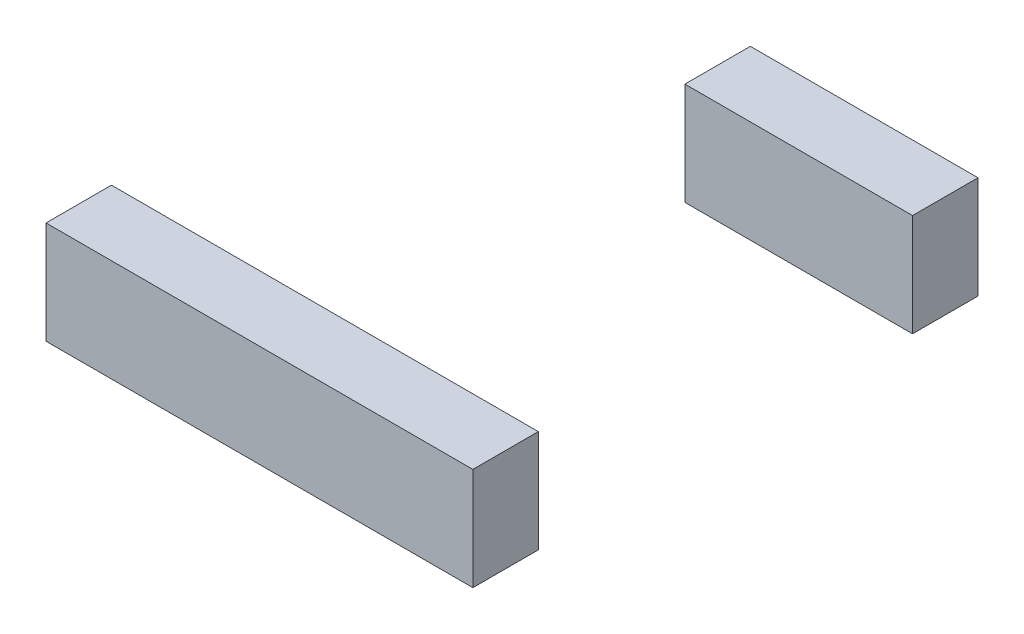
ISO-10303-21;
HEADER;
FILE_DESCRIPTION(('STEP AP214'),'2;1');
FILE_NAME('part.step','',(''),(''),'','','');
FILE_SCHEMA(('AUTOMOTIVE_DESIGN { 1 0 10303 214 1 1 1 1 }'));
ENDSEC;
DATA;
#1=APPLICATION_CONTEXT('core data for automotive mechanical design processes');
#2=APPLICATION_PROTOCOL_DEFINITION('international standard','automotive_design',2000,#1);
#3=PRODUCT_CONTEXT('',#1,'mechanical');
#4=PRODUCT('Part','Part','',(#3));
#5=PRODUCT_RELATED_PRODUCT_CATEGORY('part','',(#4));
#6=PRODUCT_DEFINITION_FORMATION('','',#4);
#7=PRODUCT_DEFINITION_CONTEXT('part definition',#1,'design');
#8=PRODUCT_DEFINITION('design','',#6,#7);
#9=PRODUCT_DEFINITION_SHAPE('','',#8);
#10=(LENGTH_UNIT() NAMED_UNIT(*) SI_UNIT(.MILLI.,.METRE.));
#11=(NAMED_UNIT(*) PLANE_ANGLE_UNIT() SI_UNIT($,.RADIAN.));
#12=(NAMED_UNIT(*) SI_UNIT($,.STERADIAN.) SOLID_ANGLE_UNIT());
#13=UNCERTAINTY_MEASURE_WITH_UNIT(LENGTH_MEASURE(1.E-05),#10,'distance_accuracy_value','');
#14=(GEOMETRIC_REPRESENTATION_CONTEXT(3) GLOBAL_UNCERTAINTY_ASSIGNED_CONTEXT((#13)) GLOBAL_UNIT_ASSIGNED_CONTEXT((#10,
#11,#12)) REPRESENTATION_CONTEXT('',''));
#15=CARTESIAN_POINT('',(0.,0.,0.));
#16=DIRECTION('',(0.,0.,1.));
#17=DIRECTION('',(1.,0.,0.));
#18=AXIS2_PLACEMENT_3D('',#15,#16,#17);
#19=CARTESIAN_POINT('',(14.,7.2,-30.9));
#20=DIRECTION('',(1.,0.,0.));
#21=DIRECTION('',(0.,0.,-1.));
#22=AXIS2_PLACEMENT_3D('',#19,#20,#21);
#23=PLANE('',#22);
#24=DIRECTION('',(0.,0.,1.));
#25=VECTOR('',#24,1.);
#26=CARTESIAN_POINT('',(14.,0.,-30.9));
#27=LINE('',#26,#25);
#28=CARTESIAN_POINT('',(14.,0.,-35.5));
#29=VERTEX_POINT('',#28);
#30=CARTESIAN_POINT('',(14.,0.,-30.9));
#31=VERTEX_POINT('',#30);
#32=EDGE_CURVE('E108',#29,#31,#27,.T.);
#33=ORIENTED_EDGE('',*,*,#32,.T.);
#34=DIRECTION('',(0.,-1.,0.));
#35=VECTOR('',#34,1.);
#36=CARTESIAN_POINT('',(14.,7.2,-30.9));
#37=LINE('',#36,#35);
#38=CARTESIAN_POINT('',(14.,7.2,-30.9));
#39=VERTEX_POINT('',#38);
#40=EDGE_CURVE('E12',#39,#31,#37,.T.);
#41=ORIENTED_EDGE('',*,*,#40,.F.);
#42=DIRECTION('',(0.,0.,1.));
#43=VECTOR('',#42,1.);
#44=CARTESIAN_POINT('',(14.,7.2,-30.9));
#45=LINE('',#44,#43);
#46=CARTESIAN_POINT('',(14.,7.2,-35.5));
#47=VERTEX_POINT('',#46);
#48=EDGE_CURVE('E96',#47,#39,#45,.T.);
#49=ORIENTED_EDGE('',*,*,#48,.F.);
#50=DIRECTION('',(0.,-1.,0.));
#51=VECTOR('',#50,1.);
#52=CARTESIAN_POINT('',(14.,7.2,-35.5));
#53=LINE('',#52,#51);
#54=EDGE_CURVE('E104',#47,#29,#53,.T.);
#55=ORIENTED_EDGE('',*,*,#54,.T.);
#56=EDGE_LOOP('',(#33,#41,#49,#55));
#57=FACE_BOUND('',#56,.T.);
#58=ADVANCED_FACE('F45',(#57),#23,.F.);
#59=CARTESIAN_POINT('',(14.,7.2,-30.9));
#60=DIRECTION('',(0.,0.,-1.));
#61=DIRECTION('',(-1.,0.,0.));
#62=AXIS2_PLACEMENT_3D('',#59,#60,#61);
#63=PLANE('',#62);
#64=DIRECTION('',(1.,0.,0.));
#65=VECTOR('',#64,1.);
#66=CARTESIAN_POINT('',(14.,0.,-30.9));
#67=LINE('',#66,#65);
#68=CARTESIAN_POINT('',(30.,0.,-30.9));
#69=VERTEX_POINT('',#68);
#70=EDGE_CURVE('E100',#31,#69,#67,.T.);
#71=ORIENTED_EDGE('',*,*,#70,.T.);
#72=DIRECTION('',(0.,-1.,0.));
#73=VECTOR('',#72,1.);
#74=CARTESIAN_POINT('',(30.,7.2,-30.9));
#75=LINE('',#74,#73);
#76=CARTESIAN_POINT('',(30.,7.2,-30.9));
#77=VERTEX_POINT('',#76);
#78=EDGE_CURVE('E53',#77,#69,#75,.T.);
#79=ORIENTED_EDGE('',*,*,#78,.F.);
#80=DIRECTION('',(1.,0.,0.));
#81=VECTOR('',#80,1.);
#82=CARTESIAN_POINT('',(14.,7.2,-30.9));
#83=LINE('',#82,#81);
#84=EDGE_CURVE('E91',#39,#77,#83,.T.);
#85=ORIENTED_EDGE('',*,*,#84,.F.);
#86=ORIENTED_EDGE('',*,*,#40,.T.);
#87=EDGE_LOOP('',(#71,#79,#85,#86));
#88=FACE_BOUND('',#87,.T.);
#89=ADVANCED_FACE('F99',(#88),#63,.F.);
#90=CARTESIAN_POINT('',(30.,7.2,-30.9));
#91=DIRECTION('',(-1.,0.,0.));
#92=DIRECTION('',(0.,0.,1.));
#93=AXIS2_PLACEMENT_3D('',#90,#91,#92);
#94=PLANE('',#93);
#95=DIRECTION('',(0.,0.,-1.));
#96=VECTOR('',#95,1.);
#97=CARTESIAN_POINT('',(30.,0.,-30.9));
#98=LINE('',#97,#96);
#99=CARTESIAN_POINT('',(30.,0.,-35.5));
#100=VERTEX_POINT('',#99);
#101=EDGE_CURVE('E78',#69,#100,#98,.T.);
#102=ORIENTED_EDGE('',*,*,#101,.T.);
#103=DIRECTION('',(0.,-1.,0.));
#104=VECTOR('',#103,1.);
#105=CARTESIAN_POINT('',(30.,7.2,-35.5));
#106=LINE('',#105,#104);
#107=CARTESIAN_POINT('',(30.,7.2,-35.5));
#108=VERTEX_POINT('',#107);
#109=EDGE_CURVE('E101',#108,#100,#106,.T.);
#110=ORIENTED_EDGE('',*,*,#109,.F.);
#111=DIRECTION('',(0.,0.,-1.));
#112=VECTOR('',#111,1.);
#113=CARTESIAN_POINT('',(30.,7.2,-30.9));
#114=LINE('',#113,#112);
#115=EDGE_CURVE('E94',#77,#108,#114,.T.);
#116=ORIENTED_EDGE('',*,*,#115,.F.);
#117=ORIENTED_EDGE('',*,*,#78,.T.);
#118=EDGE_LOOP('',(#102,#110,#116,#117));
#119=FACE_BOUND('',#118,.T.);
#120=ADVANCED_FACE('F102',(#119),#94,.F.);
#121=CARTESIAN_POINT('',(14.,7.2,-35.5));
#122=DIRECTION('',(0.,0.,1.));
#123=DIRECTION('',(1.,0.,0.));
#124=AXIS2_PLACEMENT_3D('',#121,#122,#123);
#125=PLANE('',#124);
#126=DIRECTION('',(-1.,0.,0.));
#127=VECTOR('',#126,1.);
#128=CARTESIAN_POINT('',(14.,0.,-35.5));
#129=LINE('',#128,#127);
#130=EDGE_CURVE('E84',#100,#29,#129,.T.);
#131=ORIENTED_EDGE('',*,*,#130,.T.);
#132=ORIENTED_EDGE('',*,*,#54,.F.);
#133=DIRECTION('',(-1.,0.,0.));
#134=VECTOR('',#133,1.);
#135=CARTESIAN_POINT('',(14.,7.2,-35.5));
#136=LINE('',#135,#134);
#137=EDGE_CURVE('E61',#108,#47,#136,.T.);
#138=ORIENTED_EDGE('',*,*,#137,.F.);
#139=ORIENTED_EDGE('',*,*,#109,.T.);
#140=EDGE_LOOP('',(#131,#132,#138,#139));
#141=FACE_BOUND('',#140,.T.);
#142=ADVANCED_FACE('F115',(#141),#125,.F.);
#143=CARTESIAN_POINT('',(0.,7.2,0.));
#144=DIRECTION('',(0.,-1.,0.));
#145=DIRECTION('',(0.,0.,-1.));
#146=AXIS2_PLACEMENT_3D('',#143,#144,#145);
#147=PLANE('',#146);
#148=ORIENTED_EDGE('',*,*,#48,.T.);
#149=ORIENTED_EDGE('',*,*,#84,.T.);
#150=ORIENTED_EDGE('',*,*,#115,.T.);
#151=ORIENTED_EDGE('',*,*,#137,.T.);
#152=EDGE_LOOP('',(#148,#149,#150,#151));
#153=FACE_BOUND('',#152,.T.);
#154=ADVANCED_FACE('F92',(#153),#147,.F.);
#155=CARTESIAN_POINT('',(0.,0.,0.));
#156=DIRECTION('',(0.,-1.,0.));
#157=DIRECTION('',(0.,0.,-1.));
#158=AXIS2_PLACEMENT_3D('',#155,#156,#157);
#159=PLANE('',#158);
#160=ORIENTED_EDGE('',*,*,#32,.F.);
#161=ORIENTED_EDGE('',*,*,#130,.F.);
#162=ORIENTED_EDGE('',*,*,#101,.F.);
#163=ORIENTED_EDGE('',*,*,#70,.F.);
#164=EDGE_LOOP('',(#160,#161,#162,#163));
#165=FACE_BOUND('',#164,.T.);
#166=ADVANCED_FACE('F118',(#165),#159,.T.);
#167=CLOSED_SHELL('',(#58,#89,#120,#142,#154,#166));
#168=MANIFOLD_SOLID_BREP('B2',#167);
#169=CARTESIAN_POINT('',(0.,7.2,0.));
#170=DIRECTION('',(1.,0.,0.));
#171=DIRECTION('',(0.,0.,-1.));
#172=AXIS2_PLACEMENT_3D('',#169,#170,#171);
#173=PLANE('',#172);
#174=DIRECTION('',(0.,0.,1.));
#175=VECTOR('',#174,1.);
#176=CARTESIAN_POINT('',(0.,0.,0.));
#177=LINE('',#176,#175);
#178=CARTESIAN_POINT('',(0.,0.,-4.6));
#179=VERTEX_POINT('',#178);
#180=CARTESIAN_POINT('',(0.,0.,0.));
#181=VERTEX_POINT('',#180);
#182=EDGE_CURVE('E232',#179,#181,#177,.T.);
#183=ORIENTED_EDGE('',*,*,#182,.T.);
#184=DIRECTION('',(0.,-1.,0.));
#185=VECTOR('',#184,1.);
#186=CARTESIAN_POINT('',(0.,7.2,0.));
#187=LINE('',#186,#185);
#188=CARTESIAN_POINT('',(0.,7.2,0.));
#189=VERTEX_POINT('',#188);
#190=EDGE_CURVE('E43',#189,#181,#187,.T.);
#191=ORIENTED_EDGE('',*,*,#190,.F.);
#192=DIRECTION('',(0.,0.,1.));
#193=VECTOR('',#192,1.);
#194=CARTESIAN_POINT('',(0.,7.2,0.));
#195=LINE('',#194,#193);
#196=CARTESIAN_POINT('',(0.,7.2,-4.6));
#197=VERTEX_POINT('',#196);
#198=EDGE_CURVE('E220',#197,#189,#195,.T.);
#199=ORIENTED_EDGE('',*,*,#198,.F.);
#200=DIRECTION('',(0.,-1.,0.));
#201=VECTOR('',#200,1.);
#202=CARTESIAN_POINT('',(0.,7.2,-4.6));
#203=LINE('',#202,#201);
#204=EDGE_CURVE('E228',#197,#179,#203,.T.);
#205=ORIENTED_EDGE('',*,*,#204,.T.);
#206=EDGE_LOOP('',(#183,#191,#199,#205));
#207=FACE_BOUND('',#206,.T.);
#208=ADVANCED_FACE('F169',(#207),#173,.F.);
#209=CARTESIAN_POINT('',(0.,7.2,0.));
#210=DIRECTION('',(0.,0.,-1.));
#211=DIRECTION('',(-1.,0.,0.));
#212=AXIS2_PLACEMENT_3D('',#209,#210,#211);
#213=PLANE('',#212);
#214=DIRECTION('',(1.,0.,0.));
#215=VECTOR('',#214,1.);
#216=CARTESIAN_POINT('',(0.,0.,0.));
#217=LINE('',#216,#215);
#218=CARTESIAN_POINT('',(30.,0.,0.));
#219=VERTEX_POINT('',#218);
#220=EDGE_CURVE('E224',#181,#219,#217,.T.);
#221=ORIENTED_EDGE('',*,*,#220,.T.);
#222=DIRECTION('',(0.,-1.,0.));
#223=VECTOR('',#222,1.);
#224=CARTESIAN_POINT('',(30.,7.2,0.));
#225=LINE('',#224,#223);
#226=CARTESIAN_POINT('',(30.,7.2,0.));
#227=VERTEX_POINT('',#226);
#228=EDGE_CURVE('E177',#227,#219,#225,.T.);
#229=ORIENTED_EDGE('',*,*,#228,.F.);
#230=DIRECTION('',(1.,0.,0.));
#231=VECTOR('',#230,1.);
#232=CARTESIAN_POINT('',(0.,7.2,0.));
#233=LINE('',#232,#231);
#234=EDGE_CURVE('E215',#189,#227,#233,.T.);
#235=ORIENTED_EDGE('',*,*,#234,.F.);
#236=ORIENTED_EDGE('',*,*,#190,.T.);
#237=EDGE_LOOP('',(#221,#229,#235,#236));
#238=FACE_BOUND('',#237,.T.);
#239=ADVANCED_FACE('F223',(#238),#213,.F.);
#240=CARTESIAN_POINT('',(30.,7.2,0.));
#241=DIRECTION('',(-1.,0.,0.));
#242=DIRECTION('',(0.,0.,1.));
#243=AXIS2_PLACEMENT_3D('',#240,#241,#242);
#244=PLANE('',#243);
#245=DIRECTION('',(0.,0.,-1.));
#246=VECTOR('',#245,1.);
#247=CARTESIAN_POINT('',(30.,0.,0.));
#248=LINE('',#247,#246);
#249=CARTESIAN_POINT('',(30.,0.,-4.6));
#250=VERTEX_POINT('',#249);
#251=EDGE_CURVE('E202',#219,#250,#248,.T.);
#252=ORIENTED_EDGE('',*,*,#251,.T.);
#253=DIRECTION('',(0.,-1.,0.));
#254=VECTOR('',#253,1.);
#255=CARTESIAN_POINT('',(30.,7.2,-4.6));
#256=LINE('',#255,#254);
#257=CARTESIAN_POINT('',(30.,7.2,-4.6));
#258=VERTEX_POINT('',#257);
#259=EDGE_CURVE('E225',#258,#250,#256,.T.);
#260=ORIENTED_EDGE('',*,*,#259,.F.);
#261=DIRECTION('',(0.,0.,-1.));
#262=VECTOR('',#261,1.);
#263=CARTESIAN_POINT('',(30.,7.2,0.));
#264=LINE('',#263,#262);
#265=EDGE_CURVE('E218',#227,#258,#264,.T.);
#266=ORIENTED_EDGE('',*,*,#265,.F.);
#267=ORIENTED_EDGE('',*,*,#228,.T.);
#268=EDGE_LOOP('',(#252,#260,#266,#267));
#269=FACE_BOUND('',#268,.T.);
#270=ADVANCED_FACE('F226',(#269),#244,.F.);
#271=CARTESIAN_POINT('',(0.,7.2,-4.6));
#272=DIRECTION('',(0.,0.,1.));
#273=DIRECTION('',(1.,0.,0.));
#274=AXIS2_PLACEMENT_3D('',#271,#272,#273);
#275=PLANE('',#274);
#276=DIRECTION('',(-1.,0.,0.));
#277=VECTOR('',#276,1.);
#278=CARTESIAN_POINT('',(0.,0.,-4.6));
#279=LINE('',#278,#277);
#280=EDGE_CURVE('E208',#250,#179,#279,.T.);
#281=ORIENTED_EDGE('',*,*,#280,.T.);
#282=ORIENTED_EDGE('',*,*,#204,.F.);
#283=DIRECTION('',(-1.,0.,0.));
#284=VECTOR('',#283,1.);
#285=CARTESIAN_POINT('',(0.,7.2,-4.6));
#286=LINE('',#285,#284);
#287=EDGE_CURVE('E185',#258,#197,#286,.T.);
#288=ORIENTED_EDGE('',*,*,#287,.F.);
#289=ORIENTED_EDGE('',*,*,#259,.T.);
#290=EDGE_LOOP('',(#281,#282,#288,#289));
#291=FACE_BOUND('',#290,.T.);
#292=ADVANCED_FACE('F239',(#291),#275,.F.);
#293=CARTESIAN_POINT('',(0.,7.2,0.));
#294=DIRECTION('',(0.,-1.,0.));
#295=DIRECTION('',(0.,0.,-1.));
#296=AXIS2_PLACEMENT_3D('',#293,#294,#295);
#297=PLANE('',#296);
#298=ORIENTED_EDGE('',*,*,#198,.T.);
#299=ORIENTED_EDGE('',*,*,#234,.T.);
#300=ORIENTED_EDGE('',*,*,#265,.T.);
#301=ORIENTED_EDGE('',*,*,#287,.T.);
#302=EDGE_LOOP('',(#298,#299,#300,#301));
#303=FACE_BOUND('',#302,.T.);
#304=ADVANCED_FACE('F216',(#303),#297,.F.);
#305=CARTESIAN_POINT('',(0.,0.,0.));
#306=DIRECTION('',(0.,-1.,0.));
#307=DIRECTION('',(0.,0.,-1.));
#308=AXIS2_PLACEMENT_3D('',#305,#306,#307);
#309=PLANE('',#308);
#310=ORIENTED_EDGE('',*,*,#182,.F.);
#311=ORIENTED_EDGE('',*,*,#280,.F.);
#312=ORIENTED_EDGE('',*,*,#251,.F.);
#313=ORIENTED_EDGE('',*,*,#220,.F.);
#314=EDGE_LOOP('',(#310,#311,#312,#313));
#315=FACE_BOUND('',#314,.T.);
#316=ADVANCED_FACE('F242',(#315),#309,.T.);
#317=CLOSED_SHELL('',(#208,#239,#270,#292,#304,#316));
#318=MANIFOLD_SOLID_BREP('B6',#317);
#319=ADVANCED_BREP_SHAPE_REPRESENTATION('',(#18,#168,#318),#14);
#320=SHAPE_DEFINITION_REPRESENTATION(#9,#319);
ENDSEC;
END-ISO-10303-21;
